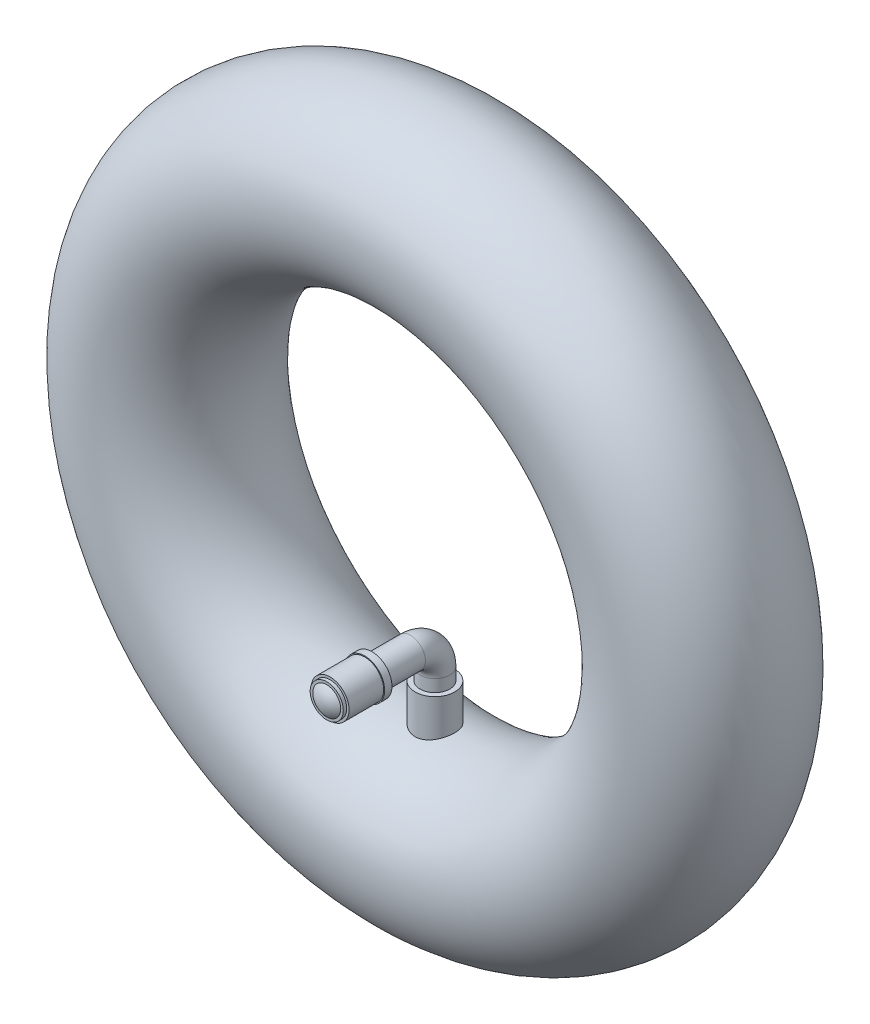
ISO-10303-21;
HEADER;
FILE_DESCRIPTION(('STEP AP214'),'2;1');
FILE_NAME('part.step','',(''),(''),'','','');
FILE_SCHEMA(('AUTOMOTIVE_DESIGN { 1 0 10303 214 1 1 1 1 }'));
ENDSEC;
DATA;
#1=APPLICATION_CONTEXT('core data for automotive mechanical design processes');
#2=APPLICATION_PROTOCOL_DEFINITION('international standard','automotive_design',2000,#1);
#3=PRODUCT_CONTEXT('',#1,'mechanical');
#4=PRODUCT('Part','Part','',(#3));
#5=PRODUCT_RELATED_PRODUCT_CATEGORY('part','',(#4));
#6=PRODUCT_DEFINITION_FORMATION('','',#4);
#7=PRODUCT_DEFINITION_CONTEXT('part definition',#1,'design');
#8=PRODUCT_DEFINITION('design','',#6,#7);
#9=PRODUCT_DEFINITION_SHAPE('','',#8);
#10=(LENGTH_UNIT() NAMED_UNIT(*) SI_UNIT(.MILLI.,.METRE.));
#11=(NAMED_UNIT(*) PLANE_ANGLE_UNIT() SI_UNIT($,.RADIAN.));
#12=(NAMED_UNIT(*) SI_UNIT($,.STERADIAN.) SOLID_ANGLE_UNIT());
#13=UNCERTAINTY_MEASURE_WITH_UNIT(LENGTH_MEASURE(1.E-05),#10,'distance_accuracy_value','');
#14=(GEOMETRIC_REPRESENTATION_CONTEXT(3) GLOBAL_UNCERTAINTY_ASSIGNED_CONTEXT((#13)) GLOBAL_UNIT_ASSIGNED_CONTEXT((#10,
#11,#12)) REPRESENTATION_CONTEXT('',''));
#15=CARTESIAN_POINT('',(0.,0.,0.));
#16=DIRECTION('',(0.,0.,1.));
#17=DIRECTION('',(1.,0.,0.));
#18=AXIS2_PLACEMENT_3D('',#15,#16,#17);
#19=CARTESIAN_POINT('',(0.,-28.575,24.1642218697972));
#20=DIRECTION('',(0.,1.,0.));
#21=DIRECTION('',(0.,0.,-1.));
#22=AXIS2_PLACEMENT_3D('',#19,#20,#21);
#23=SPHERICAL_SURFACE('',#22,5.45343772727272);
#24=CARTESIAN_POINT('',(0.,-24.9301,28.2206595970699));
#25=CARTESIAN_POINT('',(-0.102337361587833,-24.9301006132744,28.2206595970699));
#26=CARTESIAN_POINT('',(-0.204693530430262,-24.9344138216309,28.2206595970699));
#27=CARTESIAN_POINT('',(-0.408698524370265,-24.9516386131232,28.2206595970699));
#28=CARTESIAN_POINT('',(-0.510347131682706,-24.9645527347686,28.2206595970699));
#29=CARTESIAN_POINT('',(-0.712366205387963,-24.9989212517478,28.2206595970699));
#30=CARTESIAN_POINT('',(-0.812734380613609,-25.0203892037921,28.2206595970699));
#31=CARTESIAN_POINT('',(-1.01136124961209,-25.0717173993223,28.2206595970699));
#32=CARTESIAN_POINT('',(-1.10961816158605,-25.101584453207,28.2206595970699));
#33=CARTESIAN_POINT('',(-1.3997487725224,-25.2033713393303,28.2206595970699));
#34=CARTESIAN_POINT('',(-1.58747061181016,-25.2875605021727,28.2206595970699));
#35=CARTESIAN_POINT('',(-1.94609478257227,-25.486304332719,28.2206595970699));
#36=CARTESIAN_POINT('',(-2.11699647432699,-25.6008601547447,28.2206595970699));
#37=CARTESIAN_POINT('',(-2.35702080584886,-25.7928608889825,28.2206595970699));
#38=CARTESIAN_POINT('',(-2.43435276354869,-25.8602729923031,28.2206595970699));
#39=CARTESIAN_POINT('',(-2.58300956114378,-26.0013189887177,28.2206595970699));
#40=CARTESIAN_POINT('',(-2.65434012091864,-26.0749468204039,28.2206595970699));
#41=CARTESIAN_POINT('',(-2.7905762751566,-26.2279850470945,28.2206595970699));
#42=CARTESIAN_POINT('',(-2.85547894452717,-26.3073980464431,28.2206595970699));
#43=CARTESIAN_POINT('',(-2.97837017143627,-26.4714020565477,28.2206595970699));
#44=CARTESIAN_POINT('',(-3.03635712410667,-26.5559942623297,28.2206595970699));
#45=CARTESIAN_POINT('',(-3.19925851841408,-26.8166173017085,28.2206595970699));
#46=CARTESIAN_POINT('',(-3.29325720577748,-26.9996562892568,28.2206595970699));
#47=CARTESIAN_POINT('',(-3.44913353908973,-27.37881866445,28.2206595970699));
#48=CARTESIAN_POINT('',(-3.51101152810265,-27.5749419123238,28.2206595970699));
#49=CARTESIAN_POINT('',(-3.60097955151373,-27.9748184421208,28.2206595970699));
#50=CARTESIAN_POINT('',(-3.62906940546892,-28.178571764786,28.22065959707));
#51=CARTESIAN_POINT('',(-3.65063468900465,-28.5879020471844,28.2206595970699));
#52=CARTESIAN_POINT('',(-3.64411011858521,-28.7934790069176,28.2206595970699));
#53=CARTESIAN_POINT('',(-3.59665796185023,-29.200595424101,28.2206595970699));
#54=CARTESIAN_POINT('',(-3.55573055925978,-29.402134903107,28.2206595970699));
#55=CARTESIAN_POINT('',(-3.44055837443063,-29.7955772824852,28.2206595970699));
#56=CARTESIAN_POINT('',(-3.36631323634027,-29.9874800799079,28.2206595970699));
#57=CARTESIAN_POINT('',(-3.23169912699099,-30.2637775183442,28.2206595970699));
#58=CARTESIAN_POINT('',(-3.18292187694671,-30.3539945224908,28.2206595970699));
#59=CARTESIAN_POINT('',(-3.07794400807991,-30.530003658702,28.2206595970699));
#60=CARTESIAN_POINT('',(-3.02174511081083,-30.6157968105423,28.2206595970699));
#61=CARTESIAN_POINT('',(-2.90234393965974,-30.7823031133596,28.2206595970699));
#62=CARTESIAN_POINT('',(-2.8391448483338,-30.8630185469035,28.2206595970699));
#63=CARTESIAN_POINT('',(-2.70613168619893,-31.0189041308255,28.2206595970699));
#64=CARTESIAN_POINT('',(-2.63631129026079,-31.0940688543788,28.2206595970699));
#65=CARTESIAN_POINT('',(-2.41779056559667,-31.3102277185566,28.2206595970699));
#66=CARTESIAN_POINT('',(-2.25987214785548,-31.4421072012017,28.2206595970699));
#67=CARTESIAN_POINT('',(-1.92411668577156,-31.6774339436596,28.22065959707));
#68=CARTESIAN_POINT('',(-1.74628039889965,-31.7808822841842,28.2206595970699));
#69=CARTESIAN_POINT('',(-1.46845138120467,-31.9125917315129,28.2206595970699));
#70=CARTESIAN_POINT('',(-1.37387674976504,-31.95261798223,28.2206595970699));
#71=CARTESIAN_POINT('',(-1.18174287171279,-32.024533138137,28.2206595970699));
#72=CARTESIAN_POINT('',(-1.08418611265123,-32.056428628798,28.2206595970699));
#73=CARTESIAN_POINT('',(-0.886896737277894,-32.1118344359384,28.2206595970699));
#74=CARTESIAN_POINT('',(-0.787167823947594,-32.1353579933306,28.2206595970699));
#75=CARTESIAN_POINT('',(-0.586102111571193,-32.1739236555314,28.2206595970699));
#76=CARTESIAN_POINT('',(-0.484765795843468,-32.1889682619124,28.2206595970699));
#77=CARTESIAN_POINT('',(-0.319393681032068,-32.2064427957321,28.2206595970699));
#78=CARTESIAN_POINT('',(-0.255622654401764,-32.2114876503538,28.2206595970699));
#79=CARTESIAN_POINT('',(-0.127903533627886,-32.2182164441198,28.2206595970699));
#80=CARTESIAN_POINT('',(-0.0639554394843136,-32.219900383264,28.2206595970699));
#81=CARTESIAN_POINT('',(0.102337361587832,-32.2198993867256,28.2206595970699));
#82=CARTESIAN_POINT('',(0.204693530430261,-32.2155861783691,28.2206595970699));
#83=CARTESIAN_POINT('',(0.408698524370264,-32.1983613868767,28.2206595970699));
#84=CARTESIAN_POINT('',(0.510347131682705,-32.1854472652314,28.2206595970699));
#85=CARTESIAN_POINT('',(0.712366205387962,-32.1510787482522,28.2206595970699));
#86=CARTESIAN_POINT('',(0.812734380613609,-32.1296107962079,28.2206595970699));
#87=CARTESIAN_POINT('',(1.01136124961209,-32.0782826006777,28.2206595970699));
#88=CARTESIAN_POINT('',(1.10961816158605,-32.048415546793,28.2206595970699));
#89=CARTESIAN_POINT('',(1.3997487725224,-31.9466286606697,28.2206595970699));
#90=CARTESIAN_POINT('',(1.58747061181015,-31.8624394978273,28.2206595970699));
#91=CARTESIAN_POINT('',(1.94609478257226,-31.663695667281,28.2206595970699));
#92=CARTESIAN_POINT('',(2.11699647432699,-31.5491398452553,28.2206595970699));
#93=CARTESIAN_POINT('',(2.35702080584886,-31.3571391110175,28.2206595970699));
#94=CARTESIAN_POINT('',(2.43435276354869,-31.2897270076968,28.2206595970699));
#95=CARTESIAN_POINT('',(2.58300956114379,-31.1486810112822,28.2206595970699));
#96=CARTESIAN_POINT('',(2.65434012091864,-31.0750531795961,28.2206595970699));
#97=CARTESIAN_POINT('',(2.7905762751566,-30.9220149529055,28.2206595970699));
#98=CARTESIAN_POINT('',(2.85547894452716,-30.8426019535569,28.2206595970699));
#99=CARTESIAN_POINT('',(2.97837017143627,-30.6785979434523,28.2206595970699));
#100=CARTESIAN_POINT('',(3.03635712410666,-30.5940057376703,28.2206595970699));
#101=CARTESIAN_POINT('',(3.19925851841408,-30.3333826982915,28.2206595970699));
#102=CARTESIAN_POINT('',(3.29325720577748,-30.1503437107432,28.2206595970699));
#103=CARTESIAN_POINT('',(3.44913353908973,-29.77118133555,28.2206595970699));
#104=CARTESIAN_POINT('',(3.51101152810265,-29.5750580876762,28.2206595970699));
#105=CARTESIAN_POINT('',(3.60097955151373,-29.1751815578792,28.2206595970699));
#106=CARTESIAN_POINT('',(3.62906940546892,-28.971428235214,28.22065959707));
#107=CARTESIAN_POINT('',(3.65063468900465,-28.5620979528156,28.2206595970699));
#108=CARTESIAN_POINT('',(3.64411011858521,-28.3565209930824,28.2206595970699));
#109=CARTESIAN_POINT('',(3.59665796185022,-27.949404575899,28.2206595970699));
#110=CARTESIAN_POINT('',(3.55573055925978,-27.747865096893,28.2206595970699));
#111=CARTESIAN_POINT('',(3.44055837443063,-27.3544227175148,28.2206595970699));
#112=CARTESIAN_POINT('',(3.36631323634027,-27.162519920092,28.2206595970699));
#113=CARTESIAN_POINT('',(3.23169912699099,-26.8862224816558,28.2206595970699));
#114=CARTESIAN_POINT('',(3.18292187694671,-26.7960054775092,28.2206595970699));
#115=CARTESIAN_POINT('',(3.07794400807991,-26.619996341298,28.2206595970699));
#116=CARTESIAN_POINT('',(3.02174511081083,-26.5342031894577,28.2206595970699));
#117=CARTESIAN_POINT('',(2.90234393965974,-26.3676968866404,28.2206595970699));
#118=CARTESIAN_POINT('',(2.83914484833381,-26.2869814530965,28.2206595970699));
#119=CARTESIAN_POINT('',(2.70613168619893,-26.1310958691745,28.2206595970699));
#120=CARTESIAN_POINT('',(2.63631129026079,-26.0559311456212,28.2206595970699));
#121=CARTESIAN_POINT('',(2.41779056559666,-25.8397722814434,28.2206595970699));
#122=CARTESIAN_POINT('',(2.25987214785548,-25.7078927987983,28.2206595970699));
#123=CARTESIAN_POINT('',(1.92411668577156,-25.4725660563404,28.22065959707));
#124=CARTESIAN_POINT('',(1.74628039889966,-25.3691177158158,28.2206595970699));
#125=CARTESIAN_POINT('',(1.46845138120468,-25.2374082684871,28.2206595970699));
#126=CARTESIAN_POINT('',(1.37387674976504,-25.19738201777,28.2206595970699));
#127=CARTESIAN_POINT('',(1.18174287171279,-25.125466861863,28.2206595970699));
#128=CARTESIAN_POINT('',(1.08418611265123,-25.093571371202,28.2206595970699));
#129=CARTESIAN_POINT('',(0.886896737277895,-25.0381655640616,28.2206595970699));
#130=CARTESIAN_POINT('',(0.787167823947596,-25.0146420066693,28.2206595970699));
#131=CARTESIAN_POINT('',(0.586102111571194,-24.9760763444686,28.2206595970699));
#132=CARTESIAN_POINT('',(0.484765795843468,-24.9610317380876,28.2206595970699));
#133=CARTESIAN_POINT('',(0.319393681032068,-24.9435572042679,28.2206595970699));
#134=CARTESIAN_POINT('',(0.255622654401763,-24.9385123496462,28.2206595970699));
#135=CARTESIAN_POINT('',(0.127903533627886,-24.9317835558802,28.2206595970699));
#136=CARTESIAN_POINT('',(0.0639554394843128,-24.9300996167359,28.2206595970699));
#137=CARTESIAN_POINT('',(0.,-24.9301,28.2206595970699));
#138=B_SPLINE_CURVE_WITH_KNOTS('',3,(#24,#25,#26,#27,#28,#29,#30,#31,#32,#33,#34,#35,#36,#37,
#38,#39,#40,#41,#42,#43,#44,#45,#46,#47,#48,#49,#50,#51,#52,#53,#54,#55,#56,#57,#58,#59,#60,#61,
#62,#63,#64,#65,#66,#67,#68,#69,#70,#71,#72,#73,#74,#75,#76,#77,#78,#79,#80,#81,#82,#83,#84,#85,
#86,#87,#88,#89,#90,#91,#92,#93,#94,#95,#96,#97,#98,#99,#100,#101,#102,#103,#104,#105,#106,#107,
#108,#109,#110,#111,#112,#113,#114,#115,#116,#117,#118,#119,#120,#121,#122,#123,#124,#125,#126,
#127,#128,#129,#130,#131,#132,#133,#134,#135,#136,#137),.UNSPECIFIED.,.T.,.F.,(4,2,2,2,2,2,2,2,
2,2,2,2,2,2,2,2,2,2,2,2,2,2,2,2,2,2,2,2,2,2,2,2,2,2,2,2,2,2,2,2,2,2,2,2,2,2,2,2,2,2,2,2,2,2,2,2,
4),(0.,0.306953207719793,0.613997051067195,0.921529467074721,1.22931196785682,1.84340980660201,
2.45753099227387,2.76499394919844,3.07216046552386,3.37946612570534,3.68684296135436,
4.30095575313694,4.91506198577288,5.52917149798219,6.1432810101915,6.75738724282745,
7.37150003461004,7.67887687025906,7.98618253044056,8.29334904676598,8.60081200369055,
9.21493318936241,9.82903102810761,10.1368135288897,10.4443459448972,10.7513897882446,
11.0583429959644,11.2501725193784,11.4420020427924,11.7489552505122,12.0559990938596,
12.3635315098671,12.6713140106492,13.2854118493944,13.8995330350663,14.2069959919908,
14.5141625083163,14.8214681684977,15.1288450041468,15.7429577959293,16.3570640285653,
16.9711735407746,17.5852830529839,18.1993892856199,18.8135020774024,19.1208789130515,
19.428184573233,19.7353510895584,20.042814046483,20.6569352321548,21.2710330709,
21.5788155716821,21.8863479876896,22.193391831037,22.5003450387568,22.6921745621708,
22.8840040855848),.UNSPECIFIED.);
#139=CARTESIAN_POINT('',(0.,-24.9301,28.2206595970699));
#140=VERTEX_POINT('',#139);
#141=EDGE_CURVE('E18',#140,#140,#138,.T.);
#142=ORIENTED_EDGE('',*,*,#141,.T.);
#143=EDGE_LOOP('',(#142));
#144=FACE_BOUND('',#143,.T.);
#145=ADVANCED_FACE('F13',(#144),#23,.T.);
#146=CARTESIAN_POINT('',(0.,-24.257,28.2206595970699));
#147=DIRECTION('',(0.,0.,-1.));
#148=DIRECTION('',(-1.,0.,0.));
#149=AXIS2_PLACEMENT_3D('',#146,#147,#148);
#150=PLANE('',#149);
#151=CARTESIAN_POINT('',(0.,-28.575,28.2206595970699));
#152=DIRECTION('',(0.,0.,1.));
#153=DIRECTION('',(1.,0.,0.));
#154=AXIS2_PLACEMENT_3D('',#151,#152,#153);
#155=CIRCLE('',#154,4.318);
#156=CARTESIAN_POINT('',(4.318,-28.575,28.2206595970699));
#157=VERTEX_POINT('',#156);
#158=EDGE_CURVE('E102',#157,#157,#155,.F.);
#159=ORIENTED_EDGE('',*,*,#158,.F.);
#160=EDGE_LOOP('',(#159));
#161=FACE_BOUND('',#160,.T.);
#162=ORIENTED_EDGE('',*,*,#141,.F.);
#163=EDGE_LOOP('',(#162));
#164=FACE_BOUND('',#163,.T.);
#165=ADVANCED_FACE('F89',(#161,#164),#150,.F.);
#166=CARTESIAN_POINT('',(0.,-28.575,38.228344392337));
#167=DIRECTION('',(0.,0.,1.));
#168=DIRECTION('',(1.,0.,0.));
#169=AXIS2_PLACEMENT_3D('',#166,#167,#168);
#170=CYLINDRICAL_SURFACE('',#169,4.318);
#171=ORIENTED_EDGE('',*,*,#158,.T.);
#172=EDGE_LOOP('',(#171));
#173=FACE_BOUND('',#172,.T.);
#174=CARTESIAN_POINT('',(0.,-28.575,27.3316595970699));
#175=DIRECTION('',(0.,0.,1.));
#176=DIRECTION('',(1.,0.,0.));
#177=AXIS2_PLACEMENT_3D('',#174,#175,#176);
#178=CIRCLE('',#177,4.318);
#179=CARTESIAN_POINT('',(4.318,-28.575,27.3316595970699));
#180=VERTEX_POINT('',#179);
#181=EDGE_CURVE('E105',#180,#180,#178,.T.);
#182=ORIENTED_EDGE('',*,*,#181,.T.);
#183=EDGE_LOOP('',(#182));
#184=FACE_BOUND('',#183,.T.);
#185=ADVANCED_FACE('F86',(#173,#184),#170,.T.);
#186=CARTESIAN_POINT('',(0.,-24.257,27.3316595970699));
#187=DIRECTION('',(0.,0.,-1.));
#188=DIRECTION('',(-1.,0.,0.));
#189=AXIS2_PLACEMENT_3D('',#186,#187,#188);
#190=PLANE('',#189);
#191=CARTESIAN_POINT('',(0.,-28.575,27.3316595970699));
#192=DIRECTION('',(0.,0.,1.));
#193=DIRECTION('',(1.,0.,0.));
#194=AXIS2_PLACEMENT_3D('',#191,#192,#193);
#195=CIRCLE('',#194,4.953);
#196=CARTESIAN_POINT('',(4.953,-28.575,27.3316595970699));
#197=VERTEX_POINT('',#196);
#198=EDGE_CURVE('E107',#197,#197,#195,.F.);
#199=ORIENTED_EDGE('',*,*,#198,.F.);
#200=EDGE_LOOP('',(#199));
#201=FACE_BOUND('',#200,.T.);
#202=ORIENTED_EDGE('',*,*,#181,.F.);
#203=EDGE_LOOP('',(#202));
#204=FACE_BOUND('',#203,.T.);
#205=ADVANCED_FACE('F82',(#201,#204),#190,.F.);
#206=CARTESIAN_POINT('',(0.,-28.575,38.228344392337));
#207=DIRECTION('',(0.,0.,1.));
#208=DIRECTION('',(1.,0.,0.));
#209=AXIS2_PLACEMENT_3D('',#206,#207,#208);
#210=CYLINDRICAL_SURFACE('',#209,4.953);
#211=ORIENTED_EDGE('',*,*,#198,.T.);
#212=EDGE_LOOP('',(#211));
#213=FACE_BOUND('',#212,.T.);
#214=CARTESIAN_POINT('',(0.,-28.575,18.3146595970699));
#215=DIRECTION('',(0.,0.,1.));
#216=DIRECTION('',(1.,0.,0.));
#217=AXIS2_PLACEMENT_3D('',#214,#215,#216);
#218=CIRCLE('',#217,4.953);
#219=CARTESIAN_POINT('',(4.953,-28.575,18.3146595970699));
#220=VERTEX_POINT('',#219);
#221=EDGE_CURVE('E112',#220,#220,#218,.T.);
#222=ORIENTED_EDGE('',*,*,#221,.T.);
#223=EDGE_LOOP('',(#222));
#224=FACE_BOUND('',#223,.T.);
#225=ADVANCED_FACE('F78',(#213,#224),#210,.T.);
#226=CARTESIAN_POINT('',(0.,-23.368,18.3146595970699));
#227=DIRECTION('',(0.,0.,-1.));
#228=DIRECTION('',(-1.,0.,0.));
#229=AXIS2_PLACEMENT_3D('',#226,#227,#228);
#230=PLANE('',#229);
#231=CARTESIAN_POINT('',(0.,-28.575,18.3146595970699));
#232=DIRECTION('',(0.,0.,1.));
#233=DIRECTION('',(1.,0.,0.));
#234=AXIS2_PLACEMENT_3D('',#231,#232,#233);
#235=CIRCLE('',#234,5.207);
#236=CARTESIAN_POINT('',(5.207,-28.575,18.3146595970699));
#237=VERTEX_POINT('',#236);
#238=EDGE_CURVE('E115',#237,#237,#235,.F.);
#239=ORIENTED_EDGE('',*,*,#238,.F.);
#240=EDGE_LOOP('',(#239));
#241=FACE_BOUND('',#240,.T.);
#242=ORIENTED_EDGE('',*,*,#221,.F.);
#243=EDGE_LOOP('',(#242));
#244=FACE_BOUND('',#243,.T.);
#245=ADVANCED_FACE('F74',(#241,#244),#230,.F.);
#246=CARTESIAN_POINT('',(0.,-28.575,38.228344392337));
#247=DIRECTION('',(0.,0.,1.));
#248=DIRECTION('',(1.,0.,0.));
#249=AXIS2_PLACEMENT_3D('',#246,#247,#248);
#250=CYLINDRICAL_SURFACE('',#249,5.207);
#251=ORIENTED_EDGE('',*,*,#238,.T.);
#252=EDGE_LOOP('',(#251));
#253=FACE_BOUND('',#252,.T.);
#254=CARTESIAN_POINT('',(0.,-28.575,16.4096595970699));
#255=DIRECTION('',(0.,0.,1.));
#256=DIRECTION('',(1.,0.,0.));
#257=AXIS2_PLACEMENT_3D('',#254,#255,#256);
#258=CIRCLE('',#257,5.207);
#259=CARTESIAN_POINT('',(5.207,-28.575,16.4096595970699));
#260=VERTEX_POINT('',#259);
#261=EDGE_CURVE('E118',#260,#260,#258,.T.);
#262=ORIENTED_EDGE('',*,*,#261,.T.);
#263=EDGE_LOOP('',(#262));
#264=FACE_BOUND('',#263,.T.);
#265=ADVANCED_FACE('F70',(#253,#264),#250,.T.);
#266=CARTESIAN_POINT('',(0.,-28.575,16.4096595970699));
#267=DIRECTION('',(0.,0.,1.));
#268=DIRECTION('',(1.,0.,0.));
#269=AXIS2_PLACEMENT_3D('',#266,#267,#268);
#270=PLANE('',#269);
#271=ORIENTED_EDGE('',*,*,#261,.F.);
#272=EDGE_LOOP('',(#271));
#273=FACE_BOUND('',#272,.T.);
#274=CARTESIAN_POINT('',(0.,-28.575,16.4096595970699));
#275=DIRECTION('',(0.,0.,1.));
#276=DIRECTION('',(0.,-1.,0.));
#277=AXIS2_PLACEMENT_3D('',#274,#275,#276);
#278=CIRCLE('',#277,3.8735);
#279=CARTESIAN_POINT('',(0.,-32.4485,16.4096595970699));
#280=VERTEX_POINT('',#279);
#281=EDGE_CURVE('E121',#280,#280,#278,.F.);
#282=ORIENTED_EDGE('',*,*,#281,.F.);
#283=EDGE_LOOP('',(#282));
#284=FACE_BOUND('',#283,.T.);
#285=ADVANCED_FACE('F66',(#273,#284),#270,.F.);
#286=CARTESIAN_POINT('',(0.,-28.575,6.35));
#287=DIRECTION('',(0.,0.,1.));
#288=DIRECTION('',(0.,-1.,0.));
#289=AXIS2_PLACEMENT_3D('',#286,#287,#288);
#290=CYLINDRICAL_SURFACE('',#289,3.8735);
#291=ORIENTED_EDGE('',*,*,#281,.T.);
#292=EDGE_LOOP('',(#291));
#293=FACE_BOUND('',#292,.T.);
#294=CARTESIAN_POINT('',(0.,-28.575,6.35));
#295=DIRECTION('',(0.,0.,1.));
#296=DIRECTION('',(0.,1.,0.));
#297=AXIS2_PLACEMENT_3D('',#294,#295,#296);
#298=CIRCLE('',#297,3.8735);
#299=CARTESIAN_POINT('',(0.,-24.7015,6.35));
#300=VERTEX_POINT('',#299);
#301=EDGE_CURVE('E54',#300,#300,#298,.F.);
#302=ORIENTED_EDGE('',*,*,#301,.F.);
#303=EDGE_LOOP('',(#302));
#304=FACE_BOUND('',#303,.T.);
#305=ADVANCED_FACE('F62',(#293,#304),#290,.T.);
#306=CARTESIAN_POINT('',(0.,-34.925,6.35));
#307=DIRECTION('',(1.,0.,0.));
#308=DIRECTION('',(0.,0.,-1.));
#309=AXIS2_PLACEMENT_3D('',#306,#307,#308);
#310=TOROIDAL_SURFACE('',#309,6.35,3.8735);
#311=ORIENTED_EDGE('',*,*,#301,.T.);
#312=EDGE_LOOP('',(#311));
#313=FACE_BOUND('',#312,.T.);
#314=CARTESIAN_POINT('',(0.,-34.925,0.));
#315=DIRECTION('',(0.,-1.,0.));
#316=DIRECTION('',(0.,0.,-1.));
#317=AXIS2_PLACEMENT_3D('',#314,#315,#316);
#318=CIRCLE('',#317,3.8735);
#319=CARTESIAN_POINT('',(0.,-34.925,-3.8735));
#320=VERTEX_POINT('',#319);
#321=EDGE_CURVE('E51',#320,#320,#318,.T.);
#322=ORIENTED_EDGE('',*,*,#321,.F.);
#323=EDGE_LOOP('',(#322));
#324=FACE_BOUND('',#323,.T.);
#325=ADVANCED_FACE('F57',(#313,#324),#310,.T.);
#326=CARTESIAN_POINT('',(0.,-34.925,0.));
#327=DIRECTION('',(0.,-1.,0.));
#328=DIRECTION('',(0.,0.,-1.));
#329=AXIS2_PLACEMENT_3D('',#326,#327,#328);
#330=CYLINDRICAL_SURFACE('',#329,3.8735);
#331=CARTESIAN_POINT('',(0.,-38.1,0.));
#332=DIRECTION('',(0.,-1.,0.));
#333=DIRECTION('',(0.,0.,-1.));
#334=AXIS2_PLACEMENT_3D('',#331,#332,#333);
#335=CIRCLE('',#334,3.8735);
#336=CARTESIAN_POINT('',(0.,-38.1,-3.8735));
#337=VERTEX_POINT('',#336);
#338=EDGE_CURVE('E29',#337,#337,#335,.T.);
#339=ORIENTED_EDGE('',*,*,#338,.F.);
#340=EDGE_LOOP('',(#339));
#341=FACE_BOUND('',#340,.T.);
#342=ORIENTED_EDGE('',*,*,#321,.T.);
#343=EDGE_LOOP('',(#342));
#344=FACE_BOUND('',#343,.T.);
#345=ADVANCED_FACE('F61',(#341,#344),#330,.T.);
#346=CARTESIAN_POINT('',(0.,-38.1,0.));
#347=DIRECTION('',(0.,1.,0.));
#348=DIRECTION('',(0.,0.,1.));
#349=AXIS2_PLACEMENT_3D('',#346,#347,#348);
#350=PLANE('',#349);
#351=CARTESIAN_POINT('',(0.,-38.1,0.));
#352=DIRECTION('',(0.,-1.,0.));
#353=DIRECTION('',(0.,0.,-1.));
#354=AXIS2_PLACEMENT_3D('',#351,#352,#353);
#355=CIRCLE('',#354,5.1562);
#356=CARTESIAN_POINT('',(0.,-38.1,-5.1562));
#357=VERTEX_POINT('',#356);
#358=EDGE_CURVE('E24',#357,#357,#355,.T.);
#359=ORIENTED_EDGE('',*,*,#358,.F.);
#360=EDGE_LOOP('',(#359));
#361=FACE_BOUND('',#360,.T.);
#362=ORIENTED_EDGE('',*,*,#338,.T.);
#363=EDGE_LOOP('',(#362));
#364=FACE_BOUND('',#363,.T.);
#365=ADVANCED_FACE('F126',(#361,#364),#350,.T.);
#366=CARTESIAN_POINT('',(0.,0.,0.));
#367=DIRECTION('',(0.,-1.,0.));
#368=DIRECTION('',(0.,0.,-1.));
#369=AXIS2_PLACEMENT_3D('',#366,#367,#368);
#370=CYLINDRICAL_SURFACE('',#369,5.1562);
#371=CARTESIAN_POINT('',(-5.15620000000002,-47.3450549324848,0.));
#372=CARTESIAN_POINT('',(-5.15620303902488,-47.3450525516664,-0.140504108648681));
#373=CARTESIAN_POINT('',(-5.15045471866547,-47.3470242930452,-0.280973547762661));
#374=CARTESIAN_POINT('',(-5.12752301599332,-47.3548482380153,-0.560909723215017));
#375=CARTESIAN_POINT('',(-5.11033755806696,-47.3607011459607,-0.700376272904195));
#376=CARTESIAN_POINT('',(-5.06467810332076,-47.376124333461,-0.9773156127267));
#377=CARTESIAN_POINT('',(-5.03619760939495,-47.3856967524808,-1.11478720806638));
#378=CARTESIAN_POINT('',(-4.96819982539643,-47.4082868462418,-1.38673747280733));
#379=CARTESIAN_POINT('',(-4.92867833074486,-47.4213058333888,-1.52121498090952));
#380=CARTESIAN_POINT('',(-4.83906185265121,-47.4503840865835,-1.78587521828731));
#381=CARTESIAN_POINT('',(-4.78899368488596,-47.4664356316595,-1.91606788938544));
#382=CARTESIAN_POINT('',(-4.67861101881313,-47.5011679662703,-2.17172551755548));
#383=CARTESIAN_POINT('',(-4.61829266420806,-47.5198497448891,-2.29718867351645));
#384=CARTESIAN_POINT('',(-4.48790050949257,-47.5593331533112,-2.54252615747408));
#385=CARTESIAN_POINT('',(-4.41783027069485,-47.5801340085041,-2.6624025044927));
#386=CARTESIAN_POINT('',(-4.26837850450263,-47.6233282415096,-2.89595794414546));
#387=CARTESIAN_POINT('',(-4.18899363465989,-47.6457221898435,-3.00963479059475));
#388=CARTESIAN_POINT('',(-4.01868323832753,-47.6922797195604,-3.23373407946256));
#389=CARTESIAN_POINT('',(-3.9274638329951,-47.7164772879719,-3.3439262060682));
#390=CARTESIAN_POINT('',(-3.73624317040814,-47.7653058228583,-3.556304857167));
#391=CARTESIAN_POINT('',(-3.63624172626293,-47.7899367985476,-3.65849121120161));
#392=CARTESIAN_POINT('',(-3.42801369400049,-47.8389865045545,-3.85429050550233));
#393=CARTESIAN_POINT('',(-3.31978258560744,-47.8634051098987,-3.94789867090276));
#394=CARTESIAN_POINT('',(-3.09583338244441,-47.9113500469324,-4.12585296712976));
#395=CARTESIAN_POINT('',(-2.98011787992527,-47.9348766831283,-4.21020227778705));
#396=CARTESIAN_POINT('',(-2.73843872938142,-47.9810576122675,-4.37138969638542));
#397=CARTESIAN_POINT('',(-2.61227632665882,-48.0036675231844,-4.44794293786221));
#398=CARTESIAN_POINT('',(-2.35360177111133,-48.0465953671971,-4.59006837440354));
#399=CARTESIAN_POINT('',(-2.22109211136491,-48.0669141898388,-4.65564483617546));
#400=CARTESIAN_POINT('',(-1.95068806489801,-48.1046361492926,-4.77525352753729));
#401=CARTESIAN_POINT('',(-1.81279836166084,-48.122041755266,-4.82929554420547));
#402=CARTESIAN_POINT('',(-1.5325780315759,-48.1534094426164,-4.92539822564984));
#403=CARTESIAN_POINT('',(-1.39024855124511,-48.1673724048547,-4.96746195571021));
#404=CARTESIAN_POINT('',(-1.04309486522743,-48.1963313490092,-5.05392067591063));
#405=CARTESIAN_POINT('',(-0.836553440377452,-48.2094075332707,-5.09221242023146));
#406=CARTESIAN_POINT('',(-0.419981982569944,-48.2269354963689,-5.14334875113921));
#407=CARTESIAN_POINT('',(-0.209952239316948,-48.2313879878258,-5.15619544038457));
#408=CARTESIAN_POINT('',(0.140466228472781,-48.2313941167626,-5.15620305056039));
#409=CARTESIAN_POINT('',(0.280897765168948,-48.2294052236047,-5.15045779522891));
#410=CARTESIAN_POINT('',(0.56075705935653,-48.2215148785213,-5.12753864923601));
#411=CARTESIAN_POINT('',(0.700184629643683,-48.2156127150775,-5.11036268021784));
#412=CARTESIAN_POINT('',(0.97704508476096,-48.2000645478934,-5.06472917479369));
#413=CARTESIAN_POINT('',(1.11447676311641,-48.190416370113,-5.03626508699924));
#414=CARTESIAN_POINT('',(1.38634619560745,-48.1676570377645,-4.96830778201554));
#415=CARTESIAN_POINT('',(1.52078278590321,-48.1545445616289,-4.9288103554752));
#416=CARTESIAN_POINT('',(1.78535592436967,-48.1252730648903,-4.83925192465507));
#417=CARTESIAN_POINT('',(1.91550259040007,-48.1091219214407,-4.7892181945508));
#418=CARTESIAN_POINT('',(2.17107173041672,-48.074194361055,-4.67891277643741));
#419=CARTESIAN_POINT('',(2.2964924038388,-48.0554169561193,-4.61863723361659));
#420=CARTESIAN_POINT('',(2.54175177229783,-48.0157564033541,-4.48833740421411));
#421=CARTESIAN_POINT('',(2.66159246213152,-47.9948740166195,-4.41831663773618));
#422=CARTESIAN_POINT('',(2.89508534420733,-47.9515392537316,-4.2689686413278));
#423=CARTESIAN_POINT('',(3.00873529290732,-47.9290863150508,-4.18963806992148));
#424=CARTESIAN_POINT('',(3.23286438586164,-47.8824225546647,-4.01938433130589));
#425=CARTESIAN_POINT('',(3.34310881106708,-47.8581780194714,-3.92816128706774));
#426=CARTESIAN_POINT('',(3.55559301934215,-47.8092894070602,-3.73692232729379));
#427=CARTESIAN_POINT('',(3.65783263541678,-47.7846453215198,-3.6369062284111));
#428=CARTESIAN_POINT('',(3.8537370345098,-47.7356045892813,-3.42863797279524));
#429=CARTESIAN_POINT('',(3.94739711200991,-47.7112080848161,-3.32038135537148));
#430=CARTESIAN_POINT('',(4.1254521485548,-47.6633399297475,-3.09637004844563));
#431=CARTESIAN_POINT('',(4.20985029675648,-47.6398679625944,-2.98061796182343));
#432=CARTESIAN_POINT('',(4.37109797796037,-47.5938344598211,-2.73890446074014));
#433=CARTESIAN_POINT('',(4.44766665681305,-47.5713174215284,-2.61274693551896));
#434=CARTESIAN_POINT('',(4.58982331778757,-47.5285918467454,-2.35407989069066));
#435=CARTESIAN_POINT('',(4.65541556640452,-47.5083824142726,-2.22157286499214));
#436=CARTESIAN_POINT('',(4.77505538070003,-47.4708828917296,-1.95117341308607));
#437=CARTESIAN_POINT('',(4.82911266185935,-47.453590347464,-1.81328563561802));
#438=CARTESIAN_POINT('',(4.92524483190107,-47.4224390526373,-1.53307113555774));
#439=CARTESIAN_POINT('',(4.9673227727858,-47.4085794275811,-1.39074555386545));
#440=CARTESIAN_POINT('',(5.05383824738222,-47.3798344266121,-1.04351271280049));
#441=CARTESIAN_POINT('',(5.09216116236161,-47.3668611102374,-0.836886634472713));
#442=CARTESIAN_POINT('',(5.14333875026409,-47.3494734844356,-0.420147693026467));
#443=CARTESIAN_POINT('',(5.15619545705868,-47.3450584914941,-0.210035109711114));
#444=CARTESIAN_POINT('',(5.15620303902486,-47.3450525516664,0.140504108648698));
#445=CARTESIAN_POINT('',(5.15045471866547,-47.3470242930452,0.280973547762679));
#446=CARTESIAN_POINT('',(5.12752301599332,-47.3548482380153,0.560909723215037));
#447=CARTESIAN_POINT('',(5.11033755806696,-47.3607011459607,0.700376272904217));
#448=CARTESIAN_POINT('',(5.06467810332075,-47.3761243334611,0.977315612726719));
#449=CARTESIAN_POINT('',(5.03619760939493,-47.3856967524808,1.11478720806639));
#450=CARTESIAN_POINT('',(4.96819982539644,-47.4082868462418,1.38673747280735));
#451=CARTESIAN_POINT('',(4.92867833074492,-47.4213058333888,1.52121498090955));
#452=CARTESIAN_POINT('',(4.83906185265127,-47.4503840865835,1.78587521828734));
#453=CARTESIAN_POINT('',(4.78899368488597,-47.4664356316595,1.91606788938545));
#454=CARTESIAN_POINT('',(4.67861101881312,-47.5011679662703,2.17172551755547));
#455=CARTESIAN_POINT('',(4.61829266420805,-47.5198497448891,2.29718867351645));
#456=CARTESIAN_POINT('',(4.48790050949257,-47.5593331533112,2.54252615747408));
#457=CARTESIAN_POINT('',(4.41783027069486,-47.5801340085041,2.6624025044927));
#458=CARTESIAN_POINT('',(4.26837850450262,-47.6233282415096,2.89595794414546));
#459=CARTESIAN_POINT('',(4.18899363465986,-47.6457221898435,3.00963479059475));
#460=CARTESIAN_POINT('',(4.01868323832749,-47.6922797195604,3.23373407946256));
#461=CARTESIAN_POINT('',(3.92746383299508,-47.7164772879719,3.34392620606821));
#462=CARTESIAN_POINT('',(3.73624317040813,-47.7653058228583,3.55630485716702));
#463=CARTESIAN_POINT('',(3.63624172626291,-47.7899367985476,3.65849121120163));
#464=CARTESIAN_POINT('',(3.42801369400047,-47.8389865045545,3.85429050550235));
#465=CARTESIAN_POINT('',(3.31978258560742,-47.8634051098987,3.94789867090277));
#466=CARTESIAN_POINT('',(3.0958333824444,-47.9113500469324,4.12585296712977));
#467=CARTESIAN_POINT('',(2.98011787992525,-47.9348766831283,4.21020227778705));
#468=CARTESIAN_POINT('',(2.7384387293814,-47.9810576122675,4.37138969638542));
#469=CARTESIAN_POINT('',(2.61227632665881,-48.0036675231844,4.44794293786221));
#470=CARTESIAN_POINT('',(2.35360177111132,-48.0465953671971,4.59006837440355));
#471=CARTESIAN_POINT('',(2.2210921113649,-48.0669141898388,4.65564483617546));
#472=CARTESIAN_POINT('',(1.950688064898,-48.1046361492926,4.77525352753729));
#473=CARTESIAN_POINT('',(1.81279836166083,-48.122041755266,4.82929554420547));
#474=CARTESIAN_POINT('',(1.53257803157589,-48.1534094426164,4.92539822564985));
#475=CARTESIAN_POINT('',(1.3902485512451,-48.1673724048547,4.96746195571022));
#476=CARTESIAN_POINT('',(1.04309486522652,-48.1963313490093,5.05392067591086));
#477=CARTESIAN_POINT('',(0.836553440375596,-48.2094075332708,5.09221242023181));
#478=CARTESIAN_POINT('',(0.419981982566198,-48.226935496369,5.14334875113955));
#479=CARTESIAN_POINT('',(0.209952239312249,-48.2313879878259,5.15619544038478));
#480=CARTESIAN_POINT('',(-0.140466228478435,-48.2313941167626,5.15620305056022));
#481=CARTESIAN_POINT('',(-0.280897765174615,-48.2294052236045,5.1504577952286));
#482=CARTESIAN_POINT('',(-0.560757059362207,-48.2215148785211,5.12753864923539));
#483=CARTESIAN_POINT('',(-0.700184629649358,-48.2156127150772,5.11036268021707));
#484=CARTESIAN_POINT('',(-0.977045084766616,-48.2000645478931,5.0647291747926));
#485=CARTESIAN_POINT('',(-1.11447676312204,-48.1904163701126,5.03626508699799));
#486=CARTESIAN_POINT('',(-1.38634619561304,-48.167657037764,4.96830778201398));
#487=CARTESIAN_POINT('',(-1.52078278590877,-48.1545445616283,4.92881035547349));
#488=CARTESIAN_POINT('',(-1.78535592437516,-48.1252730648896,4.83925192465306));
#489=CARTESIAN_POINT('',(-1.91550259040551,-48.10912192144,4.78921819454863));
#490=CARTESIAN_POINT('',(-2.17107173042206,-48.0741943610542,4.67891277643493));
#491=CARTESIAN_POINT('',(-2.29649240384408,-48.0554169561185,4.61863723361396));
#492=CARTESIAN_POINT('',(-2.54175177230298,-48.0157564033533,4.48833740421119));
#493=CARTESIAN_POINT('',(-2.66159246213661,-47.9948740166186,4.41831663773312));
#494=CARTESIAN_POINT('',(-2.89508534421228,-47.9515392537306,4.26896864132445));
#495=CARTESIAN_POINT('',(-3.00873529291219,-47.9290863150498,4.189638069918));
#496=CARTESIAN_POINT('',(-3.23286438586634,-47.8824225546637,4.01938433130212));
#497=CARTESIAN_POINT('',(-3.34310881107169,-47.8581780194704,3.92816128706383));
#498=CARTESIAN_POINT('',(-3.55559301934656,-47.8092894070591,3.7369223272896));
#499=CARTESIAN_POINT('',(-3.65783263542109,-47.7846453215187,3.63690622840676));
#500=CARTESIAN_POINT('',(-3.8537370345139,-47.7356045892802,3.42863797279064));
#501=CARTESIAN_POINT('',(-3.9473971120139,-47.711208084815,3.32038135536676));
#502=CARTESIAN_POINT('',(-4.12545214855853,-47.6633399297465,3.09637004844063));
#503=CARTESIAN_POINT('',(-4.20985029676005,-47.6398679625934,2.98061796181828));
#504=CARTESIAN_POINT('',(-4.37109797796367,-47.5938344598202,2.73890446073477));
#505=CARTESIAN_POINT('',(-4.44766665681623,-47.5713174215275,2.61274693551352));
#506=CARTESIAN_POINT('',(-4.58982331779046,-47.5285918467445,2.35407989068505));
#507=CARTESIAN_POINT('',(-4.65541556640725,-47.5083824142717,2.22157286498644));
#508=CARTESIAN_POINT('',(-4.77505538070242,-47.4708828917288,1.95117341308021));
#509=CARTESIAN_POINT('',(-4.82911266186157,-47.4535903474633,1.8132856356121));
#510=CARTESIAN_POINT('',(-4.92524483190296,-47.4224390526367,1.5330711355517));
#511=CARTESIAN_POINT('',(-4.96732277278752,-47.4085794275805,1.39074555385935));
#512=CARTESIAN_POINT('',(-5.05383824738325,-47.3798344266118,1.0435127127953));
#513=CARTESIAN_POINT('',(-5.09216116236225,-47.3668611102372,0.836886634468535));
#514=CARTESIAN_POINT('',(-5.14333875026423,-47.3494734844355,0.420147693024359));
#515=CARTESIAN_POINT('',(-5.1561954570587,-47.3450584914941,0.210035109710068));
#516=CARTESIAN_POINT('',(-5.15620000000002,-47.3450549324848,0.));
#517=B_SPLINE_CURVE_WITH_KNOTS('',3,(#371,#372,#373,#374,#375,#376,#377,#378,#379,#380,#381,
#382,#383,#384,#385,#386,#387,#388,#389,#390,#391,#392,#393,#394,#395,#396,#397,#398,#399,#400,
#401,#402,#403,#404,#405,#406,#407,#408,#409,#410,#411,#412,#413,#414,#415,#416,#417,#418,#419,
#420,#421,#422,#423,#424,#425,#426,#427,#428,#429,#430,#431,#432,#433,#434,#435,#436,#437,#438,
#439,#440,#441,#442,#443,#444,#445,#446,#447,#448,#449,#450,#451,#452,#453,#454,#455,#456,#457,
#458,#459,#460,#461,#462,#463,#464,#465,#466,#467,#468,#469,#470,#471,#472,#473,#474,#475,#476,
#477,#478,#479,#480,#481,#482,#483,#484,#485,#486,#487,#488,#489,#490,#491,#492,#493,#494,#495,
#496,#497,#498,#499,#500,#501,#502,#503,#504,#505,#506,#507,#508,#509,#510,#511,#512,#513,#514,
#515,#516),.UNSPECIFIED.,.T.,.F.,(4,2,2,2,2,2,2,2,2,2,2,2,2,2,2,2,2,2,2,2,2,2,2,2,2,2,2,2,2,2,2,
2,2,2,2,2,2,2,2,2,2,2,2,2,2,2,2,2,2,2,2,2,2,2,2,2,2,2,2,2,2,2,2,2,2,2,2,2,2,2,2,2,4),(0.,
0.421321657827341,0.842719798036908,1.26436068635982,1.68616236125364,2.1069042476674,
2.52780477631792,2.94855199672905,3.36945066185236,3.8042047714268,4.23896813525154,
4.67397204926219,5.10882609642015,5.55615402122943,6.00330766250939,6.4500803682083,
6.89673864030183,7.52636214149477,8.15593361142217,8.57714145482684,8.99842590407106,
9.4199552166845,9.84164556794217,10.2622574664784,10.6830280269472,11.1036469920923,
11.5244173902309,11.9593207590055,12.3942331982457,12.8293827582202,13.2643820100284,
13.7116788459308,14.158801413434,14.6055458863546,15.0521764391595,15.6820470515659,
16.3118673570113,16.7331890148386,17.1545871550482,17.5762280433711,17.9980297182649,
18.4187716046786,18.8396721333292,19.2604193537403,19.6813180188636,20.1160721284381,
20.5508354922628,20.9858394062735,21.4206934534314,21.8680213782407,22.3151750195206,
22.7619477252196,23.2086059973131,23.8382294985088,24.467800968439,24.8890088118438,
25.310293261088,25.7318225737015,26.1535129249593,26.5741248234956,26.9948953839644,
27.4155143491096,27.8362847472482,28.2711881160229,28.7061005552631,29.1412501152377,
29.576249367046,30.0235462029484,30.4706687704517,30.9174132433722,31.3640437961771,
31.9939144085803,32.6237347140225),.UNSPECIFIED.);
#518=CARTESIAN_POINT('',(-5.15620000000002,-47.3450549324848,0.));
#519=VERTEX_POINT('',#518);
#520=EDGE_CURVE('E8',#519,#519,#517,.T.);
#521=ORIENTED_EDGE('',*,*,#520,.F.);
#522=EDGE_LOOP('',(#521));
#523=FACE_BOUND('',#522,.T.);
#524=ORIENTED_EDGE('',*,*,#358,.T.);
#525=EDGE_LOOP('',(#524));
#526=FACE_BOUND('',#525,.T.);
#527=ADVANCED_FACE('F38',(#523,#526),#370,.T.);
#528=CARTESIAN_POINT('',(0.,0.,0.));
#529=DIRECTION('',(0.,0.,1.));
#530=DIRECTION('',(1.,0.,0.));
#531=AXIS2_PLACEMENT_3D('',#528,#529,#530);
#532=TOROIDAL_SURFACE('',#531,69.85,22.225);
#533=ORIENTED_EDGE('',*,*,#520,.T.);
#534=EDGE_LOOP('',(#533));
#535=FACE_BOUND('',#534,.T.);
#536=ADVANCED_FACE('F41',(#535),#532,.T.);
#537=CLOSED_SHELL('',(#145,#165,#185,#205,#225,#245,#265,#285,#305,#325,#345,#365,#527,#536));
#538=CARTESIAN_POINT('',(0.,0.,0.));
#539=DIRECTION('',(0.,0.,1.));
#540=DIRECTION('',(1.,0.,0.));
#541=AXIS2_PLACEMENT_3D('',#538,#539,#540);
#542=TOROIDAL_SURFACE('',#541,69.85,21.209);
#543=ADVANCED_FACE('F46',(),#542,.F.);
#544=CLOSED_SHELL('',(#543));
#545=ORIENTED_CLOSED_SHELL('',*,#544,.T.);
#546=BREP_WITH_VOIDS('B1',#537,(#545));
#547=ADVANCED_BREP_SHAPE_REPRESENTATION('',(#18,#546),#14);
#548=SHAPE_DEFINITION_REPRESENTATION(#9,#547);
ENDSEC;
END-ISO-10303-21;
